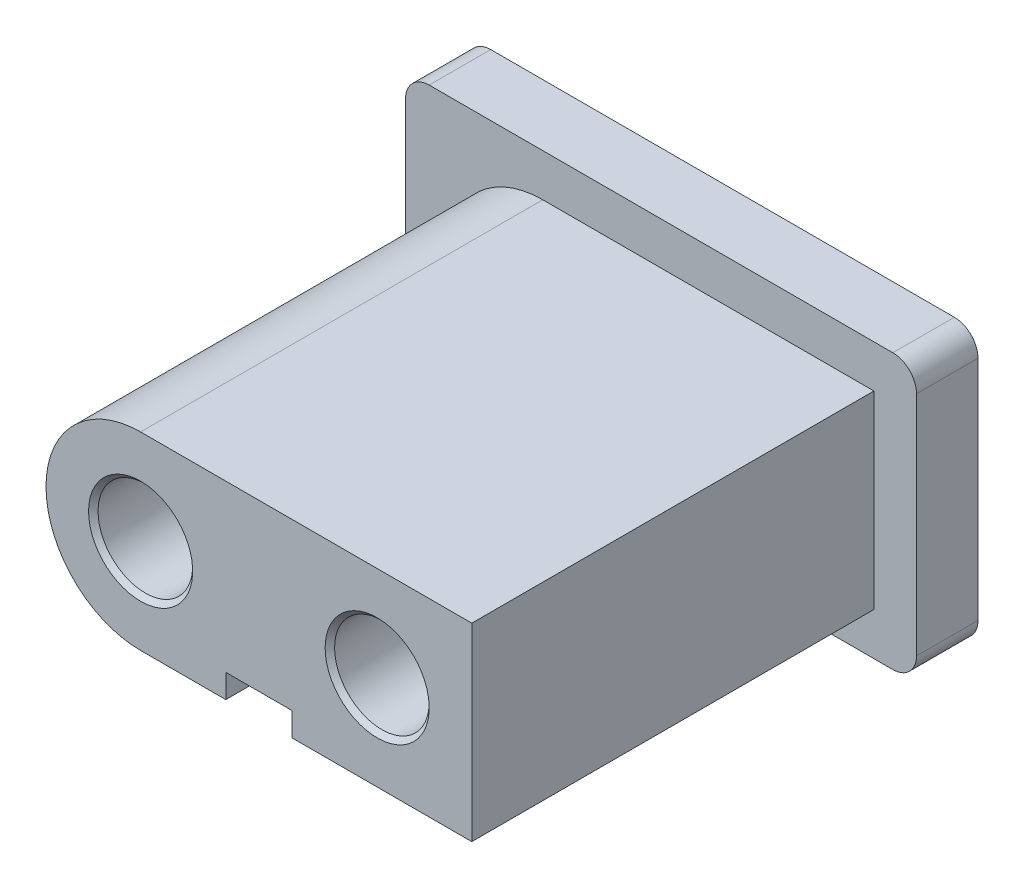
ISO-10303-21;
HEADER;
FILE_DESCRIPTION(('STEP AP214'),'2;1');
FILE_NAME('part.step','',(''),(''),'','','');
FILE_SCHEMA(('AUTOMOTIVE_DESIGN { 1 0 10303 214 1 1 1 1 }'));
ENDSEC;
DATA;
#1=APPLICATION_CONTEXT('core data for automotive mechanical design processes');
#2=APPLICATION_PROTOCOL_DEFINITION('international standard','automotive_design',2000,#1);
#3=PRODUCT_CONTEXT('',#1,'mechanical');
#4=PRODUCT('Part','Part','',(#3));
#5=PRODUCT_RELATED_PRODUCT_CATEGORY('part','',(#4));
#6=PRODUCT_DEFINITION_FORMATION('','',#4);
#7=PRODUCT_DEFINITION_CONTEXT('part definition',#1,'design');
#8=PRODUCT_DEFINITION('design','',#6,#7);
#9=PRODUCT_DEFINITION_SHAPE('','',#8);
#10=(LENGTH_UNIT() NAMED_UNIT(*) SI_UNIT(.MILLI.,.METRE.));
#11=(NAMED_UNIT(*) PLANE_ANGLE_UNIT() SI_UNIT($,.RADIAN.));
#12=(NAMED_UNIT(*) SI_UNIT($,.STERADIAN.) SOLID_ANGLE_UNIT());
#13=UNCERTAINTY_MEASURE_WITH_UNIT(LENGTH_MEASURE(1.E-05),#10,'distance_accuracy_value','');
#14=(GEOMETRIC_REPRESENTATION_CONTEXT(3) GLOBAL_UNCERTAINTY_ASSIGNED_CONTEXT((#13)) GLOBAL_UNIT_ASSIGNED_CONTEXT((#10,
#11,#12)) REPRESENTATION_CONTEXT('',''));
#15=CARTESIAN_POINT('',(0.,0.,0.));
#16=DIRECTION('',(0.,0.,1.));
#17=DIRECTION('',(1.,0.,0.));
#18=AXIS2_PLACEMENT_3D('',#15,#16,#17);
#19=CARTESIAN_POINT('',(4.9,-2.4,1.3));
#20=DIRECTION('',(0.,0.,-1.));
#21=DIRECTION('',(-1.,0.,0.));
#22=AXIS2_PLACEMENT_3D('',#19,#20,#21);
#23=CYLINDRICAL_SURFACE('',#22,0.5);
#24=CARTESIAN_POINT('',(4.9,-2.4,0.));
#25=DIRECTION('',(0.,0.,1.));
#26=DIRECTION('',(1.,0.,0.));
#27=AXIS2_PLACEMENT_3D('',#24,#25,#26);
#28=CIRCLE('',#27,0.5);
#29=CARTESIAN_POINT('',(4.9,-2.9,0.));
#30=VERTEX_POINT('',#29);
#31=CARTESIAN_POINT('',(5.4,-2.4,0.));
#32=VERTEX_POINT('',#31);
#33=EDGE_CURVE('E182',#30,#32,#28,.T.);
#34=ORIENTED_EDGE('',*,*,#33,.T.);
#35=DIRECTION('',(0.,0.,-1.));
#36=VECTOR('',#35,1.);
#37=CARTESIAN_POINT('',(5.4,-2.4,1.3));
#38=LINE('',#37,#36);
#39=CARTESIAN_POINT('',(5.4,-2.4,1.3));
#40=VERTEX_POINT('',#39);
#41=EDGE_CURVE('E242',#40,#32,#38,.T.);
#42=ORIENTED_EDGE('',*,*,#41,.F.);
#43=CARTESIAN_POINT('',(4.9,-2.4,1.3));
#44=DIRECTION('',(0.,0.,1.));
#45=DIRECTION('',(1.,0.,0.));
#46=AXIS2_PLACEMENT_3D('',#43,#44,#45);
#47=CIRCLE('',#46,0.5);
#48=CARTESIAN_POINT('',(4.9,-2.9,1.3));
#49=VERTEX_POINT('',#48);
#50=EDGE_CURVE('E191',#49,#40,#47,.T.);
#51=ORIENTED_EDGE('',*,*,#50,.F.);
#52=DIRECTION('',(0.,0.,-1.));
#53=VECTOR('',#52,1.);
#54=CARTESIAN_POINT('',(4.9,-2.9,1.3));
#55=LINE('',#54,#53);
#56=EDGE_CURVE('E208',#49,#30,#55,.T.);
#57=ORIENTED_EDGE('',*,*,#56,.T.);
#58=EDGE_LOOP('',(#34,#42,#51,#57));
#59=FACE_BOUND('',#58,.T.);
#60=ADVANCED_FACE('F36',(#59),#23,.T.);
#61=CARTESIAN_POINT('',(5.4,2.4,1.3));
#62=DIRECTION('',(-1.,0.,0.));
#63=DIRECTION('',(0.,-1.,0.));
#64=AXIS2_PLACEMENT_3D('',#61,#62,#63);
#65=PLANE('',#64);
#66=DIRECTION('',(0.,1.,0.));
#67=VECTOR('',#66,1.);
#68=CARTESIAN_POINT('',(5.4,2.4,0.));
#69=LINE('',#68,#67);
#70=CARTESIAN_POINT('',(5.4,2.4,0.));
#71=VERTEX_POINT('',#70);
#72=EDGE_CURVE('E185',#32,#71,#69,.T.);
#73=ORIENTED_EDGE('',*,*,#72,.T.);
#74=DIRECTION('',(0.,0.,-1.));
#75=VECTOR('',#74,1.);
#76=CARTESIAN_POINT('',(5.4,2.4,1.3));
#77=LINE('',#76,#75);
#78=CARTESIAN_POINT('',(5.4,2.4,1.3));
#79=VERTEX_POINT('',#78);
#80=EDGE_CURVE('E239',#79,#71,#77,.T.);
#81=ORIENTED_EDGE('',*,*,#80,.F.);
#82=DIRECTION('',(0.,1.,0.));
#83=VECTOR('',#82,1.);
#84=CARTESIAN_POINT('',(5.4,2.4,1.3));
#85=LINE('',#84,#83);
#86=EDGE_CURVE('E194',#40,#79,#85,.T.);
#87=ORIENTED_EDGE('',*,*,#86,.F.);
#88=ORIENTED_EDGE('',*,*,#41,.T.);
#89=EDGE_LOOP('',(#73,#81,#87,#88));
#90=FACE_BOUND('',#89,.T.);
#91=ADVANCED_FACE('F308',(#90),#65,.F.);
#92=CARTESIAN_POINT('',(4.9,2.4,1.3));
#93=DIRECTION('',(0.,0.,-1.));
#94=DIRECTION('',(-1.,0.,0.));
#95=AXIS2_PLACEMENT_3D('',#92,#93,#94);
#96=CYLINDRICAL_SURFACE('',#95,0.5);
#97=CARTESIAN_POINT('',(4.9,2.4,0.));
#98=DIRECTION('',(0.,0.,1.));
#99=DIRECTION('',(-1.,0.,0.));
#100=AXIS2_PLACEMENT_3D('',#97,#98,#99);
#101=CIRCLE('',#100,0.5);
#102=CARTESIAN_POINT('',(4.9,2.9,0.));
#103=VERTEX_POINT('',#102);
#104=EDGE_CURVE('E211',#71,#103,#101,.T.);
#105=ORIENTED_EDGE('',*,*,#104,.T.);
#106=DIRECTION('',(0.,0.,-1.));
#107=VECTOR('',#106,1.);
#108=CARTESIAN_POINT('',(4.9,2.9,1.3));
#109=LINE('',#108,#107);
#110=CARTESIAN_POINT('',(4.9,2.9,1.3));
#111=VERTEX_POINT('',#110);
#112=EDGE_CURVE('E236',#111,#103,#109,.T.);
#113=ORIENTED_EDGE('',*,*,#112,.F.);
#114=CARTESIAN_POINT('',(4.9,2.4,1.3));
#115=DIRECTION('',(0.,0.,1.));
#116=DIRECTION('',(-1.,0.,0.));
#117=AXIS2_PLACEMENT_3D('',#114,#115,#116);
#118=CIRCLE('',#117,0.5);
#119=EDGE_CURVE('E197',#79,#111,#118,.T.);
#120=ORIENTED_EDGE('',*,*,#119,.F.);
#121=ORIENTED_EDGE('',*,*,#80,.T.);
#122=EDGE_LOOP('',(#105,#113,#120,#121));
#123=FACE_BOUND('',#122,.T.);
#124=ADVANCED_FACE('F314',(#123),#96,.T.);
#125=CARTESIAN_POINT('',(-4.9,2.9,1.3));
#126=DIRECTION('',(0.,-1.,0.));
#127=DIRECTION('',(0.,0.,-1.));
#128=AXIS2_PLACEMENT_3D('',#125,#126,#127);
#129=PLANE('',#128);
#130=DIRECTION('',(-1.,0.,0.));
#131=VECTOR('',#130,1.);
#132=CARTESIAN_POINT('',(-4.9,2.9,0.));
#133=LINE('',#132,#131);
#134=CARTESIAN_POINT('',(-4.9,2.9,0.));
#135=VERTEX_POINT('',#134);
#136=EDGE_CURVE('E213',#103,#135,#133,.T.);
#137=ORIENTED_EDGE('',*,*,#136,.T.);
#138=DIRECTION('',(0.,0.,-1.));
#139=VECTOR('',#138,1.);
#140=CARTESIAN_POINT('',(-4.9,2.9,1.3));
#141=LINE('',#140,#139);
#142=CARTESIAN_POINT('',(-4.9,2.9,1.3));
#143=VERTEX_POINT('',#142);
#144=EDGE_CURVE('E233',#143,#135,#141,.T.);
#145=ORIENTED_EDGE('',*,*,#144,.F.);
#146=DIRECTION('',(-1.,0.,0.));
#147=VECTOR('',#146,1.);
#148=CARTESIAN_POINT('',(-4.9,2.9,1.3));
#149=LINE('',#148,#147);
#150=EDGE_CURVE('E199',#111,#143,#149,.T.);
#151=ORIENTED_EDGE('',*,*,#150,.F.);
#152=ORIENTED_EDGE('',*,*,#112,.T.);
#153=EDGE_LOOP('',(#137,#145,#151,#152));
#154=FACE_BOUND('',#153,.T.);
#155=ADVANCED_FACE('F561',(#154),#129,.F.);
#156=CARTESIAN_POINT('',(-4.9,2.4,1.3));
#157=DIRECTION('',(0.,0.,-1.));
#158=DIRECTION('',(-1.,0.,0.));
#159=AXIS2_PLACEMENT_3D('',#156,#157,#158);
#160=CYLINDRICAL_SURFACE('',#159,0.5);
#161=CARTESIAN_POINT('',(-4.9,2.4,0.));
#162=DIRECTION('',(0.,0.,1.));
#163=DIRECTION('',(1.,0.,0.));
#164=AXIS2_PLACEMENT_3D('',#161,#162,#163);
#165=CIRCLE('',#164,0.5);
#166=CARTESIAN_POINT('',(-5.4,2.4,0.));
#167=VERTEX_POINT('',#166);
#168=EDGE_CURVE('E215',#135,#167,#165,.T.);
#169=ORIENTED_EDGE('',*,*,#168,.T.);
#170=DIRECTION('',(0.,0.,-1.));
#171=VECTOR('',#170,1.);
#172=CARTESIAN_POINT('',(-5.4,2.4,1.3));
#173=LINE('',#172,#171);
#174=CARTESIAN_POINT('',(-5.4,2.4,1.3));
#175=VERTEX_POINT('',#174);
#176=EDGE_CURVE('E230',#175,#167,#173,.T.);
#177=ORIENTED_EDGE('',*,*,#176,.F.);
#178=CARTESIAN_POINT('',(-4.9,2.4,1.3));
#179=DIRECTION('',(0.,0.,1.));
#180=DIRECTION('',(1.,0.,0.));
#181=AXIS2_PLACEMENT_3D('',#178,#179,#180);
#182=CIRCLE('',#181,0.5);
#183=EDGE_CURVE('E201',#143,#175,#182,.T.);
#184=ORIENTED_EDGE('',*,*,#183,.F.);
#185=ORIENTED_EDGE('',*,*,#144,.T.);
#186=EDGE_LOOP('',(#169,#177,#184,#185));
#187=FACE_BOUND('',#186,.T.);
#188=ADVANCED_FACE('F551',(#187),#160,.T.);
#189=CARTESIAN_POINT('',(-5.4,2.4,1.3));
#190=DIRECTION('',(1.,0.,0.));
#191=DIRECTION('',(0.,0.,-1.));
#192=AXIS2_PLACEMENT_3D('',#189,#190,#191);
#193=PLANE('',#192);
#194=DIRECTION('',(0.,-1.,0.));
#195=VECTOR('',#194,1.);
#196=CARTESIAN_POINT('',(-5.4,2.4,0.));
#197=LINE('',#196,#195);
#198=CARTESIAN_POINT('',(-5.4,-2.4,0.));
#199=VERTEX_POINT('',#198);
#200=EDGE_CURVE('E217',#167,#199,#197,.T.);
#201=ORIENTED_EDGE('',*,*,#200,.T.);
#202=DIRECTION('',(0.,0.,-1.));
#203=VECTOR('',#202,1.);
#204=CARTESIAN_POINT('',(-5.4,-2.4,1.3));
#205=LINE('',#204,#203);
#206=CARTESIAN_POINT('',(-5.4,-2.4,1.3));
#207=VERTEX_POINT('',#206);
#208=EDGE_CURVE('E227',#207,#199,#205,.T.);
#209=ORIENTED_EDGE('',*,*,#208,.F.);
#210=DIRECTION('',(0.,-1.,0.));
#211=VECTOR('',#210,1.);
#212=CARTESIAN_POINT('',(-5.4,2.4,1.3));
#213=LINE('',#212,#211);
#214=EDGE_CURVE('E203',#175,#207,#213,.T.);
#215=ORIENTED_EDGE('',*,*,#214,.F.);
#216=ORIENTED_EDGE('',*,*,#176,.T.);
#217=EDGE_LOOP('',(#201,#209,#215,#216));
#218=FACE_BOUND('',#217,.T.);
#219=ADVANCED_FACE('F541',(#218),#193,.F.);
#220=CARTESIAN_POINT('',(-4.9,-2.4,1.3));
#221=DIRECTION('',(0.,0.,-1.));
#222=DIRECTION('',(-1.,0.,0.));
#223=AXIS2_PLACEMENT_3D('',#220,#221,#222);
#224=CYLINDRICAL_SURFACE('',#223,0.5);
#225=CARTESIAN_POINT('',(-4.9,-2.4,0.));
#226=DIRECTION('',(0.,0.,1.));
#227=DIRECTION('',(1.,0.,0.));
#228=AXIS2_PLACEMENT_3D('',#225,#226,#227);
#229=CIRCLE('',#228,0.5);
#230=CARTESIAN_POINT('',(-4.9,-2.9,0.));
#231=VERTEX_POINT('',#230);
#232=EDGE_CURVE('E219',#199,#231,#229,.T.);
#233=ORIENTED_EDGE('',*,*,#232,.T.);
#234=DIRECTION('',(0.,0.,-1.));
#235=VECTOR('',#234,1.);
#236=CARTESIAN_POINT('',(-4.9,-2.9,1.3));
#237=LINE('',#236,#235);
#238=CARTESIAN_POINT('',(-4.9,-2.9,1.3));
#239=VERTEX_POINT('',#238);
#240=EDGE_CURVE('E224',#239,#231,#237,.T.);
#241=ORIENTED_EDGE('',*,*,#240,.F.);
#242=CARTESIAN_POINT('',(-4.9,-2.4,1.3));
#243=DIRECTION('',(0.,0.,1.));
#244=DIRECTION('',(1.,0.,0.));
#245=AXIS2_PLACEMENT_3D('',#242,#243,#244);
#246=CIRCLE('',#245,0.5);
#247=EDGE_CURVE('E205',#207,#239,#246,.T.);
#248=ORIENTED_EDGE('',*,*,#247,.F.);
#249=ORIENTED_EDGE('',*,*,#208,.T.);
#250=EDGE_LOOP('',(#233,#241,#248,#249));
#251=FACE_BOUND('',#250,.T.);
#252=ADVANCED_FACE('F531',(#251),#224,.T.);
#253=CARTESIAN_POINT('',(-4.9,-2.9,1.3));
#254=DIRECTION('',(0.,1.,0.));
#255=DIRECTION('',(0.,0.,1.));
#256=AXIS2_PLACEMENT_3D('',#253,#254,#255);
#257=PLANE('',#256);
#258=DIRECTION('',(1.,0.,0.));
#259=VECTOR('',#258,1.);
#260=CARTESIAN_POINT('',(-4.9,-2.9,0.));
#261=LINE('',#260,#259);
#262=EDGE_CURVE('E195',#231,#30,#261,.T.);
#263=ORIENTED_EDGE('',*,*,#262,.T.);
#264=ORIENTED_EDGE('',*,*,#56,.F.);
#265=DIRECTION('',(1.,0.,0.));
#266=VECTOR('',#265,1.);
#267=CARTESIAN_POINT('',(-4.9,-2.9,1.3));
#268=LINE('',#267,#266);
#269=EDGE_CURVE('E207',#239,#49,#268,.T.);
#270=ORIENTED_EDGE('',*,*,#269,.F.);
#271=ORIENTED_EDGE('',*,*,#240,.T.);
#272=EDGE_LOOP('',(#263,#264,#270,#271));
#273=FACE_BOUND('',#272,.T.);
#274=ADVANCED_FACE('F306',(#273),#257,.F.);
#275=CARTESIAN_POINT('',(4.9,-2.4,1.3));
#276=DIRECTION('',(0.,0.,1.));
#277=DIRECTION('',(1.,0.,0.));
#278=AXIS2_PLACEMENT_3D('',#275,#276,#277);
#279=PLANE('',#278);
#280=DIRECTION('',(0.,1.,0.));
#281=VECTOR('',#280,1.);
#282=CARTESIAN_POINT('',(4.5,2.,1.3));
#283=LINE('',#282,#281);
#284=CARTESIAN_POINT('',(4.5,-2.,1.3));
#285=VERTEX_POINT('',#284);
#286=CARTESIAN_POINT('',(4.5,2.,1.3));
#287=VERTEX_POINT('',#286);
#288=EDGE_CURVE('E342',#285,#287,#283,.T.);
#289=ORIENTED_EDGE('',*,*,#288,.F.);
#290=DIRECTION('',(1.,0.,0.));
#291=VECTOR('',#290,1.);
#292=CARTESIAN_POINT('',(0.7,-2.,1.3));
#293=LINE('',#292,#291);
#294=CARTESIAN_POINT('',(0.7,-2.,1.3));
#295=VERTEX_POINT('',#294);
#296=EDGE_CURVE('E180',#295,#285,#293,.T.);
#297=ORIENTED_EDGE('',*,*,#296,.F.);
#298=DIRECTION('',(0.,-1.,0.));
#299=VECTOR('',#298,1.);
#300=CARTESIAN_POINT('',(0.7,-2.,1.3));
#301=LINE('',#300,#299);
#302=CARTESIAN_POINT('',(0.7,-1.5,1.3));
#303=VERTEX_POINT('',#302);
#304=EDGE_CURVE('E176',#303,#295,#301,.T.);
#305=ORIENTED_EDGE('',*,*,#304,.F.);
#306=DIRECTION('',(1.,0.,0.));
#307=VECTOR('',#306,1.);
#308=CARTESIAN_POINT('',(0.7,-1.5,1.3));
#309=LINE('',#308,#307);
#310=CARTESIAN_POINT('',(-0.7,-1.5,1.3));
#311=VERTEX_POINT('',#310);
#312=EDGE_CURVE('E349',#311,#303,#309,.T.);
#313=ORIENTED_EDGE('',*,*,#312,.F.);
#314=DIRECTION('',(0.,1.,0.));
#315=VECTOR('',#314,1.);
#316=CARTESIAN_POINT('',(-0.7,-2.,1.3));
#317=LINE('',#316,#315);
#318=CARTESIAN_POINT('',(-0.7,-2.,1.3));
#319=VERTEX_POINT('',#318);
#320=EDGE_CURVE('E347',#319,#311,#317,.T.);
#321=ORIENTED_EDGE('',*,*,#320,.F.);
#322=DIRECTION('',(1.,0.,0.));
#323=VECTOR('',#322,1.);
#324=CARTESIAN_POINT('',(-4.5,-2.,1.3));
#325=LINE('',#324,#323);
#326=CARTESIAN_POINT('',(-2.5,-2.,1.3));
#327=VERTEX_POINT('',#326);
#328=EDGE_CURVE('E345',#327,#319,#325,.T.);
#329=ORIENTED_EDGE('',*,*,#328,.F.);
#330=CARTESIAN_POINT('',(-2.5,0.,1.3));
#331=DIRECTION('',(0.,0.,1.));
#332=DIRECTION('',(1.,0.,0.));
#333=AXIS2_PLACEMENT_3D('',#330,#331,#332);
#334=CIRCLE('',#333,2.);
#335=CARTESIAN_POINT('',(-4.5,0.,1.3));
#336=VERTEX_POINT('',#335);
#337=EDGE_CURVE('E51',#327,#336,#334,.F.);
#338=ORIENTED_EDGE('',*,*,#337,.T.);
#339=CARTESIAN_POINT('',(-2.5,0.,1.3));
#340=DIRECTION('',(0.,0.,1.));
#341=DIRECTION('',(1.,0.,0.));
#342=AXIS2_PLACEMENT_3D('',#339,#340,#341);
#343=CIRCLE('',#342,2.);
#344=CARTESIAN_POINT('',(-2.5,2.,1.3));
#345=VERTEX_POINT('',#344);
#346=EDGE_CURVE('E259',#336,#345,#343,.F.);
#347=ORIENTED_EDGE('',*,*,#346,.T.);
#348=DIRECTION('',(-1.,0.,0.));
#349=VECTOR('',#348,1.);
#350=CARTESIAN_POINT('',(-4.5,2.,1.3));
#351=LINE('',#350,#349);
#352=EDGE_CURVE('E330',#287,#345,#351,.T.);
#353=ORIENTED_EDGE('',*,*,#352,.F.);
#354=EDGE_LOOP('',(#289,#297,#305,#313,#321,#329,#338,#347,#353));
#355=FACE_BOUND('',#354,.T.);
#356=ORIENTED_EDGE('',*,*,#50,.T.);
#357=ORIENTED_EDGE('',*,*,#86,.T.);
#358=ORIENTED_EDGE('',*,*,#119,.T.);
#359=ORIENTED_EDGE('',*,*,#150,.T.);
#360=ORIENTED_EDGE('',*,*,#183,.T.);
#361=ORIENTED_EDGE('',*,*,#214,.T.);
#362=ORIENTED_EDGE('',*,*,#247,.T.);
#363=ORIENTED_EDGE('',*,*,#269,.T.);
#364=EDGE_LOOP('',(#356,#357,#358,#359,#360,#361,#362,#363));
#365=FACE_BOUND('',#364,.T.);
#366=ADVANCED_FACE('F294',(#355,#365),#279,.T.);
#367=CARTESIAN_POINT('',(4.9,-2.4,0.));
#368=DIRECTION('',(0.,0.,1.));
#369=DIRECTION('',(1.,0.,0.));
#370=AXIS2_PLACEMENT_3D('',#367,#368,#369);
#371=PLANE('',#370);
#372=ORIENTED_EDGE('',*,*,#33,.F.);
#373=ORIENTED_EDGE('',*,*,#262,.F.);
#374=ORIENTED_EDGE('',*,*,#232,.F.);
#375=ORIENTED_EDGE('',*,*,#200,.F.);
#376=ORIENTED_EDGE('',*,*,#168,.F.);
#377=ORIENTED_EDGE('',*,*,#136,.F.);
#378=ORIENTED_EDGE('',*,*,#104,.F.);
#379=ORIENTED_EDGE('',*,*,#72,.F.);
#380=EDGE_LOOP('',(#372,#373,#374,#375,#376,#377,#378,#379));
#381=FACE_BOUND('',#380,.T.);
#382=ADVANCED_FACE('F305',(#381),#371,.F.);
#383=CARTESIAN_POINT('',(0.,0.,9.8));
#384=DIRECTION('',(0.,0.,-1.));
#385=DIRECTION('',(-1.,0.,0.));
#386=AXIS2_PLACEMENT_3D('',#383,#384,#385);
#387=PLANE('',#386);
#388=CARTESIAN_POINT('',(2.5,0.,9.8));
#389=DIRECTION('',(0.,0.,-1.));
#390=DIRECTION('',(-1.,0.,0.));
#391=AXIS2_PLACEMENT_3D('',#388,#389,#390);
#392=CIRCLE('',#391,1.1);
#393=CARTESIAN_POINT('',(1.4,0.,9.8));
#394=VERTEX_POINT('',#393);
#395=EDGE_CURVE('E44',#394,#394,#392,.T.);
#396=ORIENTED_EDGE('',*,*,#395,.T.);
#397=EDGE_LOOP('',(#396));
#398=FACE_BOUND('',#397,.T.);
#399=CARTESIAN_POINT('',(-2.5,0.,9.8));
#400=DIRECTION('',(0.,0.,-1.));
#401=DIRECTION('',(-1.,0.,0.));
#402=AXIS2_PLACEMENT_3D('',#399,#400,#401);
#403=CIRCLE('',#402,1.1);
#404=CARTESIAN_POINT('',(-3.6,0.,9.8));
#405=VERTEX_POINT('',#404);
#406=EDGE_CURVE('E268',#405,#405,#403,.T.);
#407=ORIENTED_EDGE('',*,*,#406,.T.);
#408=EDGE_LOOP('',(#407));
#409=FACE_BOUND('',#408,.T.);
#410=DIRECTION('',(-1.,0.,0.));
#411=VECTOR('',#410,1.);
#412=CARTESIAN_POINT('',(-4.5,2.,9.8));
#413=LINE('',#412,#411);
#414=CARTESIAN_POINT('',(4.5,2.,9.8));
#415=VERTEX_POINT('',#414);
#416=CARTESIAN_POINT('',(-2.5,2.,9.8));
#417=VERTEX_POINT('',#416);
#418=EDGE_CURVE('E166',#415,#417,#413,.T.);
#419=ORIENTED_EDGE('',*,*,#418,.T.);
#420=CARTESIAN_POINT('',(-2.5,0.,9.8));
#421=DIRECTION('',(0.,0.,-1.));
#422=DIRECTION('',(-1.,0.,0.));
#423=AXIS2_PLACEMENT_3D('',#420,#421,#422);
#424=CIRCLE('',#423,2.);
#425=CARTESIAN_POINT('',(-4.5,0.,9.8));
#426=VERTEX_POINT('',#425);
#427=EDGE_CURVE('E256',#417,#426,#424,.F.);
#428=ORIENTED_EDGE('',*,*,#427,.T.);
#429=CARTESIAN_POINT('',(-2.5,0.,9.8));
#430=DIRECTION('',(0.,0.,-1.));
#431=DIRECTION('',(-1.,0.,0.));
#432=AXIS2_PLACEMENT_3D('',#429,#430,#431);
#433=CIRCLE('',#432,2.);
#434=CARTESIAN_POINT('',(-2.5,-2.,9.8));
#435=VERTEX_POINT('',#434);
#436=EDGE_CURVE('E254',#426,#435,#433,.F.);
#437=ORIENTED_EDGE('',*,*,#436,.T.);
#438=DIRECTION('',(1.,0.,0.));
#439=VECTOR('',#438,1.);
#440=CARTESIAN_POINT('',(-4.5,-2.,9.8));
#441=LINE('',#440,#439);
#442=CARTESIAN_POINT('',(-0.7,-2.,9.8));
#443=VERTEX_POINT('',#442);
#444=EDGE_CURVE('E331',#435,#443,#441,.T.);
#445=ORIENTED_EDGE('',*,*,#444,.T.);
#446=DIRECTION('',(0.,1.,0.));
#447=VECTOR('',#446,1.);
#448=CARTESIAN_POINT('',(-0.7,-2.,9.8));
#449=LINE('',#448,#447);
#450=CARTESIAN_POINT('',(-0.7,-1.5,9.8));
#451=VERTEX_POINT('',#450);
#452=EDGE_CURVE('E333',#443,#451,#449,.T.);
#453=ORIENTED_EDGE('',*,*,#452,.T.);
#454=DIRECTION('',(1.,0.,0.));
#455=VECTOR('',#454,1.);
#456=CARTESIAN_POINT('',(0.7,-1.5,9.8));
#457=LINE('',#456,#455);
#458=CARTESIAN_POINT('',(0.7,-1.5,9.8));
#459=VERTEX_POINT('',#458);
#460=EDGE_CURVE('E337',#451,#459,#457,.T.);
#461=ORIENTED_EDGE('',*,*,#460,.T.);
#462=DIRECTION('',(0.,-1.,0.));
#463=VECTOR('',#462,1.);
#464=CARTESIAN_POINT('',(0.7,-2.,9.8));
#465=LINE('',#464,#463);
#466=CARTESIAN_POINT('',(0.7,-2.,9.8));
#467=VERTEX_POINT('',#466);
#468=EDGE_CURVE('E172',#459,#467,#465,.T.);
#469=ORIENTED_EDGE('',*,*,#468,.T.);
#470=DIRECTION('',(1.,0.,0.));
#471=VECTOR('',#470,1.);
#472=CARTESIAN_POINT('',(0.7,-2.,9.8));
#473=LINE('',#472,#471);
#474=CARTESIAN_POINT('',(4.5,-2.,9.8));
#475=VERTEX_POINT('',#474);
#476=EDGE_CURVE('E167',#467,#475,#473,.T.);
#477=ORIENTED_EDGE('',*,*,#476,.T.);
#478=DIRECTION('',(0.,1.,0.));
#479=VECTOR('',#478,1.);
#480=CARTESIAN_POINT('',(4.5,2.,9.8));
#481=LINE('',#480,#479);
#482=EDGE_CURVE('E155',#475,#415,#481,.T.);
#483=ORIENTED_EDGE('',*,*,#482,.T.);
#484=EDGE_LOOP('',(#419,#428,#437,#445,#453,#461,#469,#477,#483));
#485=FACE_BOUND('',#484,.T.);
#486=ADVANCED_FACE('F170',(#398,#409,#485),#387,.F.);
#487=CARTESIAN_POINT('',(0.7,-2.,9.8));
#488=DIRECTION('',(0.,1.,0.));
#489=DIRECTION('',(-1.,0.,0.));
#490=AXIS2_PLACEMENT_3D('',#487,#488,#489);
#491=PLANE('',#490);
#492=ORIENTED_EDGE('',*,*,#296,.T.);
#493=DIRECTION('',(0.,0.,-1.));
#494=VECTOR('',#493,1.);
#495=CARTESIAN_POINT('',(4.5,-2.,9.8));
#496=LINE('',#495,#494);
#497=EDGE_CURVE('E159',#475,#285,#496,.T.);
#498=ORIENTED_EDGE('',*,*,#497,.F.);
#499=ORIENTED_EDGE('',*,*,#476,.F.);
#500=DIRECTION('',(0.,0.,-1.));
#501=VECTOR('',#500,1.);
#502=CARTESIAN_POINT('',(0.7,-2.,9.8));
#503=LINE('',#502,#501);
#504=EDGE_CURVE('E340',#467,#295,#503,.T.);
#505=ORIENTED_EDGE('',*,*,#504,.T.);
#506=EDGE_LOOP('',(#492,#498,#499,#505));
#507=FACE_BOUND('',#506,.T.);
#508=ADVANCED_FACE('F178',(#507),#491,.F.);
#509=CARTESIAN_POINT('',(4.5,2.,9.8));
#510=DIRECTION('',(-1.,0.,0.));
#511=DIRECTION('',(0.,-1.,0.));
#512=AXIS2_PLACEMENT_3D('',#509,#510,#511);
#513=PLANE('',#512);
#514=ORIENTED_EDGE('',*,*,#288,.T.);
#515=DIRECTION('',(0.,0.,-1.));
#516=VECTOR('',#515,1.);
#517=CARTESIAN_POINT('',(4.5,2.,9.8));
#518=LINE('',#517,#516);
#519=EDGE_CURVE('E162',#415,#287,#518,.T.);
#520=ORIENTED_EDGE('',*,*,#519,.F.);
#521=ORIENTED_EDGE('',*,*,#482,.F.);
#522=ORIENTED_EDGE('',*,*,#497,.T.);
#523=EDGE_LOOP('',(#514,#520,#521,#522));
#524=FACE_BOUND('',#523,.T.);
#525=ADVANCED_FACE('F157',(#524),#513,.F.);
#526=CARTESIAN_POINT('',(-4.5,2.,9.8));
#527=DIRECTION('',(0.,-1.,0.));
#528=DIRECTION('',(0.,0.,-1.));
#529=AXIS2_PLACEMENT_3D('',#526,#527,#528);
#530=PLANE('',#529);
#531=ORIENTED_EDGE('',*,*,#352,.T.);
#532=DIRECTION('',(0.,0.,-1.));
#533=VECTOR('',#532,1.);
#534=CARTESIAN_POINT('',(-2.5,2.,9.8));
#535=LINE('',#534,#533);
#536=EDGE_CURVE('E251',#345,#417,#535,.F.);
#537=ORIENTED_EDGE('',*,*,#536,.T.);
#538=ORIENTED_EDGE('',*,*,#418,.F.);
#539=ORIENTED_EDGE('',*,*,#519,.T.);
#540=EDGE_LOOP('',(#531,#537,#538,#539));
#541=FACE_BOUND('',#540,.T.);
#542=ADVANCED_FACE('F328',(#541),#530,.F.);
#543=CARTESIAN_POINT('',(-4.5,-2.,9.8));
#544=DIRECTION('',(0.,1.,0.));
#545=DIRECTION('',(0.,0.,1.));
#546=AXIS2_PLACEMENT_3D('',#543,#544,#545);
#547=PLANE('',#546);
#548=ORIENTED_EDGE('',*,*,#444,.F.);
#549=DIRECTION('',(0.,0.,-1.));
#550=VECTOR('',#549,1.);
#551=CARTESIAN_POINT('',(-2.5,-2.,9.8));
#552=LINE('',#551,#550);
#553=EDGE_CURVE('E59',#435,#327,#552,.T.);
#554=ORIENTED_EDGE('',*,*,#553,.T.);
#555=ORIENTED_EDGE('',*,*,#328,.T.);
#556=DIRECTION('',(0.,0.,-1.));
#557=VECTOR('',#556,1.);
#558=CARTESIAN_POINT('',(-0.7,-2.,9.8));
#559=LINE('',#558,#557);
#560=EDGE_CURVE('E187',#443,#319,#559,.T.);
#561=ORIENTED_EDGE('',*,*,#560,.F.);
#562=EDGE_LOOP('',(#548,#554,#555,#561));
#563=FACE_BOUND('',#562,.T.);
#564=ADVANCED_FACE('F372',(#563),#547,.F.);
#565=CARTESIAN_POINT('',(-0.7,-2.,9.8));
#566=DIRECTION('',(-1.,0.,0.));
#567=DIRECTION('',(0.,-1.,0.));
#568=AXIS2_PLACEMENT_3D('',#565,#566,#567);
#569=PLANE('',#568);
#570=ORIENTED_EDGE('',*,*,#320,.T.);
#571=DIRECTION('',(0.,0.,-1.));
#572=VECTOR('',#571,1.);
#573=CARTESIAN_POINT('',(-0.7,-1.5,9.8));
#574=LINE('',#573,#572);
#575=EDGE_CURVE('E356',#451,#311,#574,.T.);
#576=ORIENTED_EDGE('',*,*,#575,.F.);
#577=ORIENTED_EDGE('',*,*,#452,.F.);
#578=ORIENTED_EDGE('',*,*,#560,.T.);
#579=EDGE_LOOP('',(#570,#576,#577,#578));
#580=FACE_BOUND('',#579,.T.);
#581=ADVANCED_FACE('F363',(#580),#569,.F.);
#582=CARTESIAN_POINT('',(0.7,-1.5,9.8));
#583=DIRECTION('',(0.,1.,0.));
#584=DIRECTION('',(-1.,0.,0.));
#585=AXIS2_PLACEMENT_3D('',#582,#583,#584);
#586=PLANE('',#585);
#587=ORIENTED_EDGE('',*,*,#312,.T.);
#588=DIRECTION('',(0.,0.,-1.));
#589=VECTOR('',#588,1.);
#590=CARTESIAN_POINT('',(0.7,-1.5,9.8));
#591=LINE('',#590,#589);
#592=EDGE_CURVE('E354',#459,#303,#591,.T.);
#593=ORIENTED_EDGE('',*,*,#592,.F.);
#594=ORIENTED_EDGE('',*,*,#460,.F.);
#595=ORIENTED_EDGE('',*,*,#575,.T.);
#596=EDGE_LOOP('',(#587,#593,#594,#595));
#597=FACE_BOUND('',#596,.T.);
#598=ADVANCED_FACE('F370',(#597),#586,.F.);
#599=CARTESIAN_POINT('',(0.7,-2.,9.8));
#600=DIRECTION('',(1.,0.,0.));
#601=DIRECTION('',(0.,0.,-1.));
#602=AXIS2_PLACEMENT_3D('',#599,#600,#601);
#603=PLANE('',#602);
#604=ORIENTED_EDGE('',*,*,#304,.T.);
#605=ORIENTED_EDGE('',*,*,#504,.F.);
#606=ORIENTED_EDGE('',*,*,#468,.F.);
#607=ORIENTED_EDGE('',*,*,#592,.T.);
#608=EDGE_LOOP('',(#604,#605,#606,#607));
#609=FACE_BOUND('',#608,.T.);
#610=ADVANCED_FACE('F285',(#609),#603,.F.);
#611=CARTESIAN_POINT('',(2.5,0.,9.8));
#612=DIRECTION('',(0.,0.,-1.));
#613=DIRECTION('',(-1.,0.,0.));
#614=AXIS2_PLACEMENT_3D('',#611,#612,#613);
#615=CYLINDRICAL_SURFACE('',#614,1.);
#616=CARTESIAN_POINT('',(2.5,0.,9.7));
#617=DIRECTION('',(0.,0.,-1.));
#618=DIRECTION('',(-1.,0.,0.));
#619=AXIS2_PLACEMENT_3D('',#616,#617,#618);
#620=CIRCLE('',#619,1.);
#621=CARTESIAN_POINT('',(1.5,0.,9.7));
#622=VERTEX_POINT('',#621);
#623=EDGE_CURVE('E262',#622,#622,#620,.F.);
#624=ORIENTED_EDGE('',*,*,#623,.T.);
#625=EDGE_LOOP('',(#624));
#626=FACE_BOUND('',#625,.T.);
#627=CARTESIAN_POINT('',(2.5,0.,1.3));
#628=DIRECTION('',(0.,0.,1.));
#629=DIRECTION('',(1.,0.,0.));
#630=AXIS2_PLACEMENT_3D('',#627,#628,#629);
#631=CIRCLE('',#630,1.);
#632=CARTESIAN_POINT('',(3.5,0.,1.3));
#633=VERTEX_POINT('',#632);
#634=EDGE_CURVE('E248',#633,#633,#631,.F.);
#635=ORIENTED_EDGE('',*,*,#634,.T.);
#636=EDGE_LOOP('',(#635));
#637=FACE_BOUND('',#636,.T.);
#638=ADVANCED_FACE('F281',(#626,#637),#615,.F.);
#639=CARTESIAN_POINT('',(-2.5,0.,9.8));
#640=DIRECTION('',(0.,0.,-1.));
#641=DIRECTION('',(-1.,0.,0.));
#642=AXIS2_PLACEMENT_3D('',#639,#640,#641);
#643=CYLINDRICAL_SURFACE('',#642,1.);
#644=CARTESIAN_POINT('',(-2.5,0.,9.7));
#645=DIRECTION('',(0.,0.,-1.));
#646=DIRECTION('',(-1.,0.,0.));
#647=AXIS2_PLACEMENT_3D('',#644,#645,#646);
#648=CIRCLE('',#647,1.);
#649=CARTESIAN_POINT('',(-3.5,0.,9.7));
#650=VERTEX_POINT('',#649);
#651=EDGE_CURVE('E11',#650,#650,#648,.F.);
#652=ORIENTED_EDGE('',*,*,#651,.T.);
#653=EDGE_LOOP('',(#652));
#654=FACE_BOUND('',#653,.T.);
#655=CARTESIAN_POINT('',(-2.5,0.,1.3));
#656=DIRECTION('',(0.,0.,1.));
#657=DIRECTION('',(1.,0.,0.));
#658=AXIS2_PLACEMENT_3D('',#655,#656,#657);
#659=CIRCLE('',#658,1.);
#660=CARTESIAN_POINT('',(-1.5,0.,1.3));
#661=VERTEX_POINT('',#660);
#662=EDGE_CURVE('E245',#661,#661,#659,.F.);
#663=ORIENTED_EDGE('',*,*,#662,.T.);
#664=EDGE_LOOP('',(#663));
#665=FACE_BOUND('',#664,.T.);
#666=ADVANCED_FACE('F284',(#654,#665),#643,.F.);
#667=ORIENTED_EDGE('',*,*,#662,.F.);
#668=EDGE_LOOP('',(#667));
#669=FACE_BOUND('',#668,.T.);
#670=ADVANCED_FACE('F292',(#669),#279,.T.);
#671=ORIENTED_EDGE('',*,*,#634,.F.);
#672=EDGE_LOOP('',(#671));
#673=FACE_BOUND('',#672,.T.);
#674=ADVANCED_FACE('F289',(#673),#279,.T.);
#675=CARTESIAN_POINT('',(-2.5,0.,9.8));
#676=DIRECTION('',(0.,0.,-1.));
#677=DIRECTION('',(-1.,0.,0.));
#678=AXIS2_PLACEMENT_3D('',#675,#676,#677);
#679=CYLINDRICAL_SURFACE('',#678,2.);
#680=ORIENTED_EDGE('',*,*,#553,.F.);
#681=ORIENTED_EDGE('',*,*,#436,.F.);
#682=DIRECTION('',(0.,0.,-1.));
#683=VECTOR('',#682,1.);
#684=CARTESIAN_POINT('',(-4.5,0.,9.8));
#685=LINE('',#684,#683);
#686=EDGE_CURVE('E263',#336,#426,#685,.F.);
#687=ORIENTED_EDGE('',*,*,#686,.F.);
#688=ORIENTED_EDGE('',*,*,#337,.F.);
#689=EDGE_LOOP('',(#680,#681,#687,#688));
#690=FACE_BOUND('',#689,.T.);
#691=ADVANCED_FACE('F291',(#690),#679,.T.);
#692=CARTESIAN_POINT('',(-2.5,0.,9.8));
#693=DIRECTION('',(0.,0.,-1.));
#694=DIRECTION('',(-1.,0.,0.));
#695=AXIS2_PLACEMENT_3D('',#692,#693,#694);
#696=CYLINDRICAL_SURFACE('',#695,2.);
#697=ORIENTED_EDGE('',*,*,#427,.F.);
#698=ORIENTED_EDGE('',*,*,#536,.F.);
#699=ORIENTED_EDGE('',*,*,#346,.F.);
#700=ORIENTED_EDGE('',*,*,#686,.T.);
#701=EDGE_LOOP('',(#697,#698,#699,#700));
#702=FACE_BOUND('',#701,.T.);
#703=ADVANCED_FACE('F278',(#702),#696,.T.);
#704=CARTESIAN_POINT('',(2.5,0.,9.7));
#705=DIRECTION('',(0.,0.,1.));
#706=DIRECTION('',(1.,0.,0.));
#707=AXIS2_PLACEMENT_3D('',#704,#705,#706);
#708=CONICAL_SURFACE('',#707,1.,0.785398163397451);
#709=ORIENTED_EDGE('',*,*,#395,.F.);
#710=EDGE_LOOP('',(#709));
#711=FACE_BOUND('',#710,.T.);
#712=ORIENTED_EDGE('',*,*,#623,.F.);
#713=EDGE_LOOP('',(#712));
#714=FACE_BOUND('',#713,.T.);
#715=ADVANCED_FACE('F275',(#711,#714),#708,.F.);
#716=CARTESIAN_POINT('',(-2.5,0.,9.7));
#717=DIRECTION('',(0.,0.,1.));
#718=DIRECTION('',(1.,0.,0.));
#719=AXIS2_PLACEMENT_3D('',#716,#717,#718);
#720=CONICAL_SURFACE('',#719,1.,0.785398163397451);
#721=ORIENTED_EDGE('',*,*,#406,.F.);
#722=EDGE_LOOP('',(#721));
#723=FACE_BOUND('',#722,.T.);
#724=ORIENTED_EDGE('',*,*,#651,.F.);
#725=EDGE_LOOP('',(#724));
#726=FACE_BOUND('',#725,.T.);
#727=ADVANCED_FACE('F38',(#723,#726),#720,.F.);
#728=CLOSED_SHELL('',(#60,#91,#124,#155,#188,#219,#252,#274,#366,#382,#486,#508,#525,#542,#564,
#581,#598,#610,#638,#666,#670,#674,#691,#703,#715,#727));
#729=MANIFOLD_SOLID_BREP('B2',#728);
#730=ADVANCED_BREP_SHAPE_REPRESENTATION('',(#18,#729),#14);
#731=SHAPE_DEFINITION_REPRESENTATION(#9,#730);
ENDSEC;
END-ISO-10303-21;
